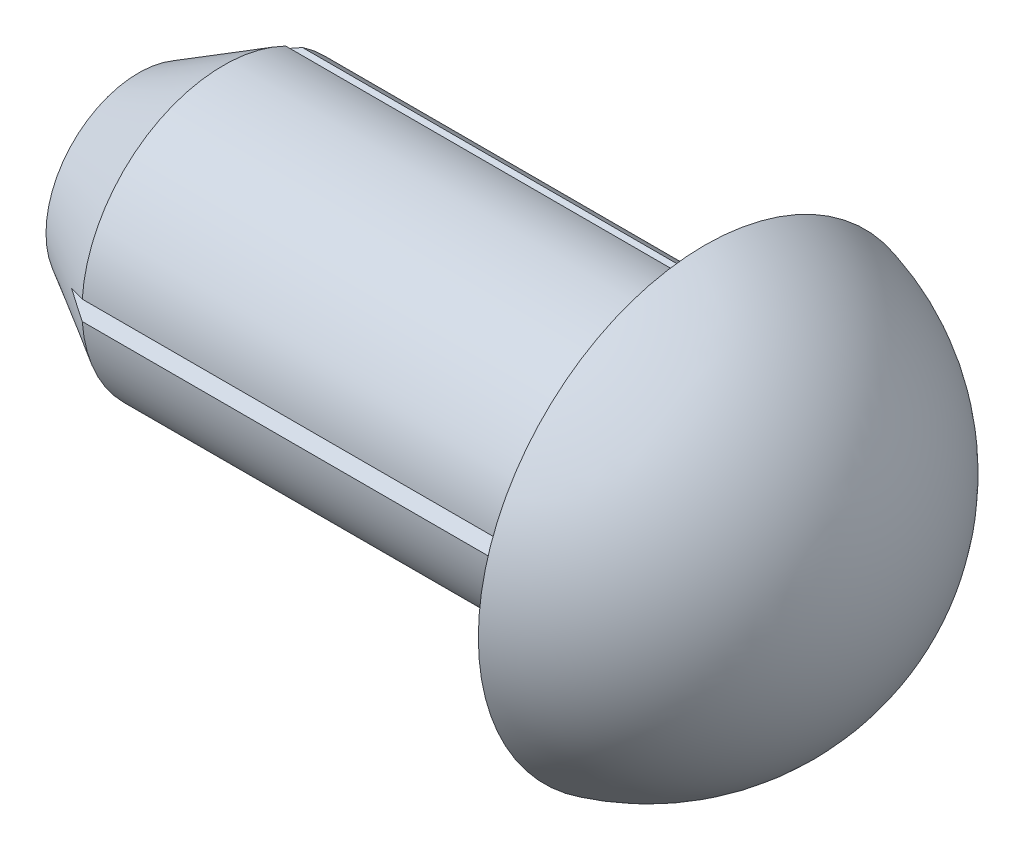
ISO-10303-21;
HEADER;
FILE_DESCRIPTION(('STEP AP214'),'2;1');
FILE_NAME('part.step','',(''),(''),'','','');
FILE_SCHEMA(('AUTOMOTIVE_DESIGN { 1 0 10303 214 1 1 1 1 }'));
ENDSEC;
DATA;
#1=APPLICATION_CONTEXT('core data for automotive mechanical design processes');
#2=APPLICATION_PROTOCOL_DEFINITION('international standard','automotive_design',2000,#1);
#3=PRODUCT_CONTEXT('',#1,'mechanical');
#4=PRODUCT('Part','Part','',(#3));
#5=PRODUCT_RELATED_PRODUCT_CATEGORY('part','',(#4));
#6=PRODUCT_DEFINITION_FORMATION('','',#4);
#7=PRODUCT_DEFINITION_CONTEXT('part definition',#1,'design');
#8=PRODUCT_DEFINITION('design','',#6,#7);
#9=PRODUCT_DEFINITION_SHAPE('','',#8);
#10=(LENGTH_UNIT() NAMED_UNIT(*) SI_UNIT(.MILLI.,.METRE.));
#11=(NAMED_UNIT(*) PLANE_ANGLE_UNIT() SI_UNIT($,.RADIAN.));
#12=(NAMED_UNIT(*) SI_UNIT($,.STERADIAN.) SOLID_ANGLE_UNIT());
#13=UNCERTAINTY_MEASURE_WITH_UNIT(LENGTH_MEASURE(1.E-05),#10,'distance_accuracy_value','');
#14=(GEOMETRIC_REPRESENTATION_CONTEXT(3) GLOBAL_UNCERTAINTY_ASSIGNED_CONTEXT((#13)) GLOBAL_UNIT_ASSIGNED_CONTEXT((#10,
#11,#12)) REPRESENTATION_CONTEXT('',''));
#15=CARTESIAN_POINT('',(0.,0.,0.));
#16=DIRECTION('',(0.,0.,1.));
#17=DIRECTION('',(1.,0.,0.));
#18=AXIS2_PLACEMENT_3D('',#15,#16,#17);
#19=CARTESIAN_POINT('',(-4.03112887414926,0.,0.));
#20=DIRECTION('',(-1.,0.,0.));
#21=DIRECTION('',(0.,1.,0.));
#22=AXIS2_PLACEMENT_3D('',#19,#20,#21);
#23=SPHERICAL_SURFACE('',#22,16.5);
#24=CARTESIAN_POINT('',(0.,0.,0.));
#25=DIRECTION('',(-1.,0.,0.));
#26=DIRECTION('',(0.,0.,1.));
#27=AXIS2_PLACEMENT_3D('',#24,#25,#26);
#28=CIRCLE('',#27,16.);
#29=CARTESIAN_POINT('',(0.,0.,16.));
#30=VERTEX_POINT('',#29);
#31=EDGE_CURVE('E161',#30,#30,#28,.T.);
#32=ORIENTED_EDGE('',*,*,#31,.F.);
#33=EDGE_LOOP('',(#32));
#34=FACE_BOUND('',#33,.T.);
#35=ADVANCED_FACE('F33',(#34),#23,.T.);
#36=CARTESIAN_POINT('',(0.,10.,0.));
#37=DIRECTION('',(1.,0.,0.));
#38=DIRECTION('',(0.,0.,-1.));
#39=AXIS2_PLACEMENT_3D('',#36,#37,#38);
#40=PLANE('',#39);
#41=CARTESIAN_POINT('',(0.,0.,0.));
#42=DIRECTION('',(-1.,0.,0.));
#43=DIRECTION('',(0.,0.,1.));
#44=AXIS2_PLACEMENT_3D('',#41,#42,#43);
#45=CIRCLE('',#44,10.);
#46=CARTESIAN_POINT('',(0.,0.,10.));
#47=VERTEX_POINT('',#46);
#48=EDGE_CURVE('E157',#47,#47,#45,.T.);
#49=ORIENTED_EDGE('',*,*,#48,.F.);
#50=EDGE_LOOP('',(#49));
#51=FACE_BOUND('',#50,.T.);
#52=ORIENTED_EDGE('',*,*,#31,.T.);
#53=EDGE_LOOP('',(#52));
#54=FACE_BOUND('',#53,.T.);
#55=ADVANCED_FACE('F205',(#51,#54),#40,.F.);
#56=CARTESIAN_POINT('',(-40.,0.,0.));
#57=DIRECTION('',(-1.,0.,0.));
#58=DIRECTION('',(0.,0.,1.));
#59=AXIS2_PLACEMENT_3D('',#56,#57,#58);
#60=CYLINDRICAL_SURFACE('',#59,10.);
#61=CARTESIAN_POINT('',(-3.,0.,0.));
#62=DIRECTION('',(-1.,0.,0.));
#63=DIRECTION('',(0.,0.,1.));
#64=AXIS2_PLACEMENT_3D('',#61,#62,#63);
#65=CIRCLE('',#64,10.);
#66=CARTESIAN_POINT('',(-3.,8.98189101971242,-4.39609300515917));
#67=VERTEX_POINT('',#66);
#68=CARTESIAN_POINT('',(-3.,8.29807372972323,-5.58049929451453));
#69=VERTEX_POINT('',#68);
#70=EDGE_CURVE('E11',#67,#69,#65,.T.);
#71=ORIENTED_EDGE('',*,*,#70,.F.);
#72=DIRECTION('',(-1.,0.,0.));
#73=VECTOR('',#72,1.);
#74=CARTESIAN_POINT('',(-40.,8.98189101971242,-4.39609300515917));
#75=LINE('',#74,#73);
#76=CARTESIAN_POINT('',(-34.,8.98189101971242,-4.39609300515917));
#77=VERTEX_POINT('',#76);
#78=EDGE_CURVE('E119',#67,#77,#75,.T.);
#79=ORIENTED_EDGE('',*,*,#78,.T.);
#80=CARTESIAN_POINT('',(-34.,0.,0.));
#81=DIRECTION('',(-1.,0.,0.));
#82=DIRECTION('',(0.,0.,1.));
#83=AXIS2_PLACEMENT_3D('',#80,#81,#82);
#84=CIRCLE('',#83,10.);
#85=CARTESIAN_POINT('',(-34.,0.683817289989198,9.97659229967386));
#86=VERTEX_POINT('',#85);
#87=EDGE_CURVE('E154',#86,#77,#84,.T.);
#88=ORIENTED_EDGE('',*,*,#87,.F.);
#89=DIRECTION('',(-1.,0.,0.));
#90=VECTOR('',#89,1.);
#91=CARTESIAN_POINT('',(-40.,0.683817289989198,9.97659229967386));
#92=LINE('',#91,#90);
#93=CARTESIAN_POINT('',(-3.,0.683817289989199,9.97659229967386));
#94=VERTEX_POINT('',#93);
#95=EDGE_CURVE('E144',#86,#94,#92,.F.);
#96=ORIENTED_EDGE('',*,*,#95,.T.);
#97=CARTESIAN_POINT('',(-3.,0.,0.));
#98=DIRECTION('',(-1.,0.,0.));
#99=DIRECTION('',(0.,0.,1.));
#100=AXIS2_PLACEMENT_3D('',#97,#98,#99);
#101=CIRCLE('',#100,10.);
#102=CARTESIAN_POINT('',(-3.,-0.683817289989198,9.97659229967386));
#103=VERTEX_POINT('',#102);
#104=EDGE_CURVE('E233',#103,#94,#101,.T.);
#105=ORIENTED_EDGE('',*,*,#104,.F.);
#106=DIRECTION('',(-1.,0.,0.));
#107=VECTOR('',#106,1.);
#108=CARTESIAN_POINT('',(-40.,-0.683817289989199,9.97659229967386));
#109=LINE('',#108,#107);
#110=CARTESIAN_POINT('',(-34.,-0.683817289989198,9.97659229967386));
#111=VERTEX_POINT('',#110);
#112=EDGE_CURVE('E147',#103,#111,#109,.T.);
#113=ORIENTED_EDGE('',*,*,#112,.T.);
#114=CARTESIAN_POINT('',(-34.,-8.98189101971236,-4.3960930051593));
#115=VERTEX_POINT('',#114);
#116=EDGE_CURVE('E153',#115,#111,#84,.T.);
#117=ORIENTED_EDGE('',*,*,#116,.F.);
#118=DIRECTION('',(-1.,0.,0.));
#119=VECTOR('',#118,1.);
#120=CARTESIAN_POINT('',(-40.,-8.98189101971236,-4.3960930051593));
#121=LINE('',#120,#119);
#122=CARTESIAN_POINT('',(-3.,-8.98189101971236,-4.3960930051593));
#123=VERTEX_POINT('',#122);
#124=EDGE_CURVE('E55',#115,#123,#121,.F.);
#125=ORIENTED_EDGE('',*,*,#124,.T.);
#126=CARTESIAN_POINT('',(-3.,0.,0.));
#127=DIRECTION('',(-1.,0.,0.));
#128=DIRECTION('',(0.,0.,1.));
#129=AXIS2_PLACEMENT_3D('',#126,#127,#128);
#130=CIRCLE('',#129,10.);
#131=CARTESIAN_POINT('',(-3.,-8.29807372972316,-5.58049929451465));
#132=VERTEX_POINT('',#131);
#133=EDGE_CURVE('E262',#132,#123,#130,.T.);
#134=ORIENTED_EDGE('',*,*,#133,.F.);
#135=DIRECTION('',(-1.,0.,0.));
#136=VECTOR('',#135,1.);
#137=CARTESIAN_POINT('',(-40.,-8.29807372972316,-5.58049929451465));
#138=LINE('',#137,#136);
#139=CARTESIAN_POINT('',(-34.,-8.29807372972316,-5.58049929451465));
#140=VERTEX_POINT('',#139);
#141=EDGE_CURVE('E133',#132,#140,#138,.T.);
#142=ORIENTED_EDGE('',*,*,#141,.T.);
#143=CARTESIAN_POINT('',(-34.,8.29807372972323,-5.58049929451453));
#144=VERTEX_POINT('',#143);
#145=EDGE_CURVE('E158',#144,#140,#84,.T.);
#146=ORIENTED_EDGE('',*,*,#145,.F.);
#147=DIRECTION('',(-1.,0.,0.));
#148=VECTOR('',#147,1.);
#149=CARTESIAN_POINT('',(-40.,8.29807372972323,-5.58049929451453));
#150=LINE('',#149,#148);
#151=EDGE_CURVE('E47',#144,#69,#150,.F.);
#152=ORIENTED_EDGE('',*,*,#151,.T.);
#153=EDGE_LOOP('',(#71,#79,#88,#96,#105,#113,#117,#125,#134,#142,#146,#152));
#154=FACE_BOUND('',#153,.T.);
#155=ORIENTED_EDGE('',*,*,#48,.T.);
#156=EDGE_LOOP('',(#155));
#157=FACE_BOUND('',#156,.T.);
#158=ADVANCED_FACE('F202',(#154,#157),#60,.T.);
#159=CARTESIAN_POINT('',(-34.,0.,0.));
#160=DIRECTION('',(1.,0.,0.));
#161=DIRECTION('',(0.,0.,-1.));
#162=AXIS2_PLACEMENT_3D('',#159,#160,#161);
#163=CONICAL_SURFACE('',#162,10.,0.523598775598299);
#164=CARTESIAN_POINT('',(-40.,0.,0.));
#165=DIRECTION('',(-1.,0.,0.));
#166=DIRECTION('',(0.,0.,1.));
#167=AXIS2_PLACEMENT_3D('',#164,#165,#166);
#168=CIRCLE('',#167,6.53589838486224);
#169=CARTESIAN_POINT('',(-40.,0.,6.53589838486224));
#170=VERTEX_POINT('',#169);
#171=EDGE_CURVE('E150',#170,#170,#168,.T.);
#172=ORIENTED_EDGE('',*,*,#171,.F.);
#173=EDGE_LOOP('',(#172));
#174=FACE_BOUND('',#173,.T.);
#175=ORIENTED_EDGE('',*,*,#87,.T.);
#176=CARTESIAN_POINT('',(-33.9998,8.98202532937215,-4.39608125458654));
#177=CARTESIAN_POINT('',(-34.145138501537,8.88442165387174,-4.4046204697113));
#178=CARTESIAN_POINT('',(-34.2902715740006,8.78651373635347,-4.41318630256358));
#179=CARTESIAN_POINT('',(-34.5800731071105,8.59002629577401,-4.4303767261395));
#180=CARTESIAN_POINT('',(-34.7247415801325,8.49144679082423,-4.43900131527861));
#181=CARTESIAN_POINT('',(-35.0135685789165,8.29354740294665,-4.45631526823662));
#182=CARTESIAN_POINT('',(-35.1577271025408,8.1942275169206,-4.46500463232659));
#183=CARTESIAN_POINT('',(-35.445474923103,7.99476476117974,-4.48245536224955));
#184=CARTESIAN_POINT('',(-35.5890642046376,7.89462186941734,-4.49121673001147));
#185=CARTESIAN_POINT('',(-35.7323356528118,7.79402863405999,-4.50001749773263));
#186=B_SPLINE_CURVE_WITH_KNOTS('',3,(#176,#177,#178,#179,#180,#181,#182,#183,#184,#185),
.UNSPECIFIED.,.F.,.F.,(4,2,2,2,4),(0.,0.52583670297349,1.05165928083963,1.57748406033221,
2.10332297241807),.UNSPECIFIED.);
#187=CARTESIAN_POINT('',(-35.7320508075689,7.79422863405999,-4.49999999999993));
#188=VERTEX_POINT('',#187);
#189=EDGE_CURVE('E40',#77,#188,#186,.T.);
#190=ORIENTED_EDGE('',*,*,#189,.T.);
#191=CARTESIAN_POINT('',(-35.7323639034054,7.79413537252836,-4.49979999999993));
#192=CARTESIAN_POINT('',(-35.5890901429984,7.8368110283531,-4.59131823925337));
#193=CARTESIAN_POINT('',(-35.4454985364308,7.87929562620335,-4.68242675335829));
#194=CARTESIAN_POINT('',(-35.1577460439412,7.96391565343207,-4.86389498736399));
#195=CARTESIAN_POINT('',(-35.0135851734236,8.00605109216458,-4.95425472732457));
#196=CARTESIAN_POINT('',(-34.7247534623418,8.09000786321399,-5.13430060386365));
#197=CARTESIAN_POINT('',(-34.5800826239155,8.13182919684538,-5.2239867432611));
#198=CARTESIAN_POINT('',(-34.2902763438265,8.21518695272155,-5.40274802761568));
#199=CARTESIAN_POINT('',(-34.1451408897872,8.25672336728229,-5.49182315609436));
#200=CARTESIAN_POINT('',(-33.9998000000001,8.29813070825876,-5.58062148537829));
#201=B_SPLINE_CURVE_WITH_KNOTS('',3,(#191,#192,#193,#194,#195,#196,#197,#198,#199,#200),
.UNSPECIFIED.,.F.,.F.,(4,2,2,2,4),(0.,0.525847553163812,1.05168097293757,1.57751219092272,
2.10335753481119),.UNSPECIFIED.);
#202=EDGE_CURVE('E112',#188,#144,#201,.T.);
#203=ORIENTED_EDGE('',*,*,#202,.T.);
#204=ORIENTED_EDGE('',*,*,#145,.T.);
#205=CARTESIAN_POINT('',(-33.9998,-8.29813070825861,-5.58062148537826));
#206=CARTESIAN_POINT('',(-34.1451408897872,-8.25672336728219,-5.49182315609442));
#207=CARTESIAN_POINT('',(-34.2902763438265,-8.21518695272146,-5.40274802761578));
#208=CARTESIAN_POINT('',(-34.5800826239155,-8.13182919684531,-5.22398674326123));
#209=CARTESIAN_POINT('',(-34.7247534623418,-8.09000786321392,-5.13430060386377));
#210=CARTESIAN_POINT('',(-35.0135851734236,-8.00605109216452,-4.95425472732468));
#211=CARTESIAN_POINT('',(-35.1577460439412,-7.963915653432,-4.8638949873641));
#212=CARTESIAN_POINT('',(-35.4454985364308,-7.87929562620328,-4.6824267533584));
#213=CARTESIAN_POINT('',(-35.5890901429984,-7.83681102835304,-4.59131823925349));
#214=CARTESIAN_POINT('',(-35.7323639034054,-7.7941353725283,-4.49980000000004));
#215=B_SPLINE_CURVE_WITH_KNOTS('',3,(#205,#206,#207,#208,#209,#210,#211,#212,#213,#214),
.UNSPECIFIED.,.F.,.F.,(4,2,2,2,4),(0.,0.525845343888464,1.05167656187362,1.57750998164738,
2.10335753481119),.UNSPECIFIED.);
#216=CARTESIAN_POINT('',(-35.7320508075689,-7.79422863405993,-4.50000000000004));
#217=VERTEX_POINT('',#216);
#218=EDGE_CURVE('E236',#140,#217,#215,.T.);
#219=ORIENTED_EDGE('',*,*,#218,.T.);
#220=CARTESIAN_POINT('',(-35.7323356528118,-7.79402863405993,-4.50001749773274));
#221=CARTESIAN_POINT('',(-35.5890642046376,-7.89462186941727,-4.49121673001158));
#222=CARTESIAN_POINT('',(-35.445474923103,-7.99476476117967,-4.48245536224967));
#223=CARTESIAN_POINT('',(-35.1577271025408,-8.19422751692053,-4.4650046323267));
#224=CARTESIAN_POINT('',(-35.0135685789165,-8.29354740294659,-4.45631526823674));
#225=CARTESIAN_POINT('',(-34.7247415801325,-8.49144679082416,-4.43900131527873));
#226=CARTESIAN_POINT('',(-34.5800731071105,-8.59002629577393,-4.43037672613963));
#227=CARTESIAN_POINT('',(-34.2902715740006,-8.78651373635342,-4.4131863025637));
#228=CARTESIAN_POINT('',(-34.145138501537,-8.88442165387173,-4.40462046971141));
#229=CARTESIAN_POINT('',(-33.9998000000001,-8.98202532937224,-4.39608125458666));
#230=B_SPLINE_CURVE_WITH_KNOTS('',3,(#220,#221,#222,#223,#224,#225,#226,#227,#228,#229),
.UNSPECIFIED.,.F.,.F.,(4,2,2,2,4),(0.,0.525838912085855,1.05166369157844,1.57748626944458,
2.10332297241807),.UNSPECIFIED.);
#231=EDGE_CURVE('E230',#217,#115,#230,.T.);
#232=ORIENTED_EDGE('',*,*,#231,.T.);
#233=ORIENTED_EDGE('',*,*,#116,.T.);
#234=CARTESIAN_POINT('',(-33.9998,-0.683894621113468,9.97670273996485));
#235=CARTESIAN_POINT('',(-34.1451437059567,-0.627695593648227,9.89644221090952));
#236=CARTESIAN_POINT('',(-34.2902819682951,-0.571321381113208,9.81593149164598));
#237=CARTESIAN_POINT('',(-34.5800938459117,-0.458186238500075,9.65435776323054));
#238=CARTESIAN_POINT('',(-34.7247674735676,-0.401425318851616,9.57329476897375));
#239=CARTESIAN_POINT('',(-35.0136047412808,-0.287477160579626,9.41055993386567));
#240=CARTESIAN_POINT('',(-35.1577683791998,-0.230289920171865,9.32888809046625));
#241=CARTESIAN_POINT('',(-35.4455263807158,-0.115441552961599,9.16486762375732));
#242=CARTESIAN_POINT('',(-35.5891207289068,-0.0577804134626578,9.08251898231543));
#243=CARTESIAN_POINT('',(-35.7323972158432,0.000140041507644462,8.9998));
#244=B_SPLINE_CURVE_WITH_KNOTS('',3,(#234,#235,#236,#237,#238,#239,#240,#241,#242,#243),
.UNSPECIFIED.,.F.,.F.,(4,2,2,2,4),(0.,0.525855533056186,1.05169693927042,1.57754054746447,
2.10339828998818),.UNSPECIFIED.);
#245=CARTESIAN_POINT('',(-35.7320508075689,0.,9.));
#246=VERTEX_POINT('',#245);
#247=EDGE_CURVE('E172',#111,#246,#244,.T.);
#248=ORIENTED_EDGE('',*,*,#247,.T.);
#249=CARTESIAN_POINT('',(-35.7323972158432,-0.000140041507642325,8.9998));
#250=CARTESIAN_POINT('',(-35.5891207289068,0.0577804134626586,9.08251898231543));
#251=CARTESIAN_POINT('',(-35.4455263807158,0.115441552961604,9.16486762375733));
#252=CARTESIAN_POINT('',(-35.1577683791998,0.230289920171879,9.32888809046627));
#253=CARTESIAN_POINT('',(-35.0136047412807,0.287477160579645,9.4105599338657));
#254=CARTESIAN_POINT('',(-34.7247674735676,0.401425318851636,9.57329476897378));
#255=CARTESIAN_POINT('',(-34.5800938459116,0.458186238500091,9.65435776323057));
#256=CARTESIAN_POINT('',(-34.290281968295,0.571321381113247,9.81593149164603));
#257=CARTESIAN_POINT('',(-34.1451437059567,0.627695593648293,9.89644221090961));
#258=CARTESIAN_POINT('',(-33.9998,0.683894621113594,9.97670273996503));
#259=B_SPLINE_CURVE_WITH_KNOTS('',3,(#249,#250,#251,#252,#253,#254,#255,#256,#257,#258),
.UNSPECIFIED.,.F.,.F.,(4,2,2,2,4),(0.,0.525857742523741,1.05170135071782,1.57754275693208,
2.10339828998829),.UNSPECIFIED.);
#260=EDGE_CURVE('E164',#246,#86,#259,.T.);
#261=ORIENTED_EDGE('',*,*,#260,.T.);
#262=EDGE_LOOP('',(#175,#190,#203,#204,#219,#232,#233,#248,#261));
#263=FACE_BOUND('',#262,.T.);
#264=ADVANCED_FACE('F178',(#174,#263),#163,.T.);
#265=CARTESIAN_POINT('',(-40.,0.,0.));
#266=DIRECTION('',(1.,0.,0.));
#267=DIRECTION('',(0.,0.,-1.));
#268=AXIS2_PLACEMENT_3D('',#265,#266,#267);
#269=PLANE('',#268);
#270=ORIENTED_EDGE('',*,*,#171,.T.);
#271=EDGE_LOOP('',(#270));
#272=FACE_BOUND('',#271,.T.);
#273=ADVANCED_FACE('F194',(#272),#269,.F.);
#274=CARTESIAN_POINT('',(-3.,0.,9.));
#275=DIRECTION('',(-1.,0.,0.));
#276=DIRECTION('',(0.,0.,1.));
#277=AXIS2_PLACEMENT_3D('',#274,#275,#276);
#278=PLANE('',#277);
#279=ORIENTED_EDGE('',*,*,#104,.T.);
#280=DIRECTION('',(0.,-0.573576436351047,-0.819152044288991));
#281=VECTOR('',#280,1.);
#282=CARTESIAN_POINT('',(-3.,0.,9.));
#283=LINE('',#282,#281);
#284=CARTESIAN_POINT('',(-3.,0.,9.));
#285=VERTEX_POINT('',#284);
#286=EDGE_CURVE('E139',#94,#285,#283,.T.);
#287=ORIENTED_EDGE('',*,*,#286,.T.);
#288=DIRECTION('',(0.,-0.573576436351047,0.819152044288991));
#289=VECTOR('',#288,1.);
#290=CARTESIAN_POINT('',(-3.,0.,9.));
#291=LINE('',#290,#289);
#292=EDGE_CURVE('E136',#285,#103,#291,.T.);
#293=ORIENTED_EDGE('',*,*,#292,.T.);
#294=EDGE_LOOP('',(#279,#287,#293));
#295=FACE_BOUND('',#294,.T.);
#296=ADVANCED_FACE('F189',(#295),#278,.T.);
#297=CARTESIAN_POINT('',(-3.,0.,9.));
#298=DIRECTION('',(0.,-0.819152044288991,-0.573576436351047));
#299=DIRECTION('',(0.,0.573576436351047,-0.819152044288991));
#300=AXIS2_PLACEMENT_3D('',#297,#298,#299);
#301=PLANE('',#300);
#302=ORIENTED_EDGE('',*,*,#292,.F.);
#303=DIRECTION('',(-1.,0.,0.));
#304=VECTOR('',#303,1.);
#305=CARTESIAN_POINT('',(-3.,0.,9.));
#306=LINE('',#305,#304);
#307=EDGE_CURVE('E141',#285,#246,#306,.T.);
#308=ORIENTED_EDGE('',*,*,#307,.T.);
#309=ORIENTED_EDGE('',*,*,#247,.F.);
#310=ORIENTED_EDGE('',*,*,#112,.F.);
#311=EDGE_LOOP('',(#302,#308,#309,#310));
#312=FACE_BOUND('',#311,.T.);
#313=ADVANCED_FACE('F187',(#312),#301,.F.);
#314=CARTESIAN_POINT('',(-3.,0.,9.));
#315=DIRECTION('',(0.,0.819152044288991,-0.573576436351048));
#316=DIRECTION('',(0.,0.573576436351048,0.819152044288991));
#317=AXIS2_PLACEMENT_3D('',#314,#315,#316);
#318=PLANE('',#317);
#319=ORIENTED_EDGE('',*,*,#260,.F.);
#320=ORIENTED_EDGE('',*,*,#307,.F.);
#321=ORIENTED_EDGE('',*,*,#286,.F.);
#322=ORIENTED_EDGE('',*,*,#95,.F.);
#323=EDGE_LOOP('',(#319,#320,#321,#322));
#324=FACE_BOUND('',#323,.T.);
#325=ADVANCED_FACE('F182',(#324),#318,.F.);
#326=CARTESIAN_POINT('',(-3.,-7.79422863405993,-4.50000000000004));
#327=DIRECTION('',(-1.,0.,0.));
#328=DIRECTION('',(0.,-0.866025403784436,-0.500000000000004));
#329=AXIS2_PLACEMENT_3D('',#326,#327,#328);
#330=PLANE('',#329);
#331=DIRECTION('',(0.,-0.422618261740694,-0.906307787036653));
#332=VECTOR('',#331,1.);
#333=CARTESIAN_POINT('',(-3.,-7.79422863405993,-4.50000000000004));
#334=LINE('',#333,#332);
#335=CARTESIAN_POINT('',(-3.,-7.79422863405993,-4.50000000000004));
#336=VERTEX_POINT('',#335);
#337=EDGE_CURVE('E124',#336,#132,#334,.T.);
#338=ORIENTED_EDGE('',*,*,#337,.T.);
#339=ORIENTED_EDGE('',*,*,#133,.T.);
#340=DIRECTION('',(0.,0.996194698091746,-0.0871557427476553));
#341=VECTOR('',#340,1.);
#342=CARTESIAN_POINT('',(-3.,-7.79422863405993,-4.50000000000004));
#343=LINE('',#342,#341);
#344=EDGE_CURVE('E127',#123,#336,#343,.T.);
#345=ORIENTED_EDGE('',*,*,#344,.T.);
#346=EDGE_LOOP('',(#338,#339,#345));
#347=FACE_BOUND('',#346,.T.);
#348=ADVANCED_FACE('F186',(#347),#330,.T.);
#349=CARTESIAN_POINT('',(-3.,-7.79422863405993,-4.50000000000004));
#350=DIRECTION('',(0.,0.906307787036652,-0.422618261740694));
#351=DIRECTION('',(0.,0.422618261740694,0.906307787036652));
#352=AXIS2_PLACEMENT_3D('',#349,#350,#351);
#353=PLANE('',#352);
#354=ORIENTED_EDGE('',*,*,#337,.F.);
#355=DIRECTION('',(-1.,0.,0.));
#356=VECTOR('',#355,1.);
#357=CARTESIAN_POINT('',(-3.,-7.79422863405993,-4.50000000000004));
#358=LINE('',#357,#356);
#359=EDGE_CURVE('E129',#336,#217,#358,.T.);
#360=ORIENTED_EDGE('',*,*,#359,.T.);
#361=ORIENTED_EDGE('',*,*,#218,.F.);
#362=ORIENTED_EDGE('',*,*,#141,.F.);
#363=EDGE_LOOP('',(#354,#360,#361,#362));
#364=FACE_BOUND('',#363,.T.);
#365=ADVANCED_FACE('F251',(#364),#353,.F.);
#366=CARTESIAN_POINT('',(-3.,-7.79422863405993,-4.50000000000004));
#367=DIRECTION('',(0.,0.0871557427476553,0.996194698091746));
#368=DIRECTION('',(0.,-0.996194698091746,0.0871557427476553));
#369=AXIS2_PLACEMENT_3D('',#366,#367,#368);
#370=PLANE('',#369);
#371=ORIENTED_EDGE('',*,*,#231,.F.);
#372=ORIENTED_EDGE('',*,*,#359,.F.);
#373=ORIENTED_EDGE('',*,*,#344,.F.);
#374=ORIENTED_EDGE('',*,*,#124,.F.);
#375=EDGE_LOOP('',(#371,#372,#373,#374));
#376=FACE_BOUND('',#375,.T.);
#377=ADVANCED_FACE('F247',(#376),#370,.F.);
#378=CARTESIAN_POINT('',(-3.,7.79422863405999,-4.49999999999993));
#379=DIRECTION('',(-1.,0.,0.));
#380=DIRECTION('',(0.,0.866025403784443,-0.499999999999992));
#381=AXIS2_PLACEMENT_3D('',#378,#379,#380);
#382=PLANE('',#381);
#383=DIRECTION('',(0.,0.996194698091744,0.0871557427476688));
#384=VECTOR('',#383,1.);
#385=CARTESIAN_POINT('',(-3.,7.79422863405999,-4.49999999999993));
#386=LINE('',#385,#384);
#387=CARTESIAN_POINT('',(-3.,7.79422863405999,-4.49999999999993));
#388=VERTEX_POINT('',#387);
#389=EDGE_CURVE('E107',#388,#67,#386,.T.);
#390=ORIENTED_EDGE('',*,*,#389,.T.);
#391=ORIENTED_EDGE('',*,*,#70,.T.);
#392=DIRECTION('',(0.,-0.422618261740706,0.906307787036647));
#393=VECTOR('',#392,1.);
#394=CARTESIAN_POINT('',(-3.,7.79422863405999,-4.49999999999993));
#395=LINE('',#394,#393);
#396=EDGE_CURVE('E103',#69,#388,#395,.T.);
#397=ORIENTED_EDGE('',*,*,#396,.T.);
#398=EDGE_LOOP('',(#390,#391,#397));
#399=FACE_BOUND('',#398,.T.);
#400=ADVANCED_FACE('F105',(#399),#382,.T.);
#401=CARTESIAN_POINT('',(-3.,7.79422863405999,-4.49999999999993));
#402=DIRECTION('',(0.,-0.0871557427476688,0.996194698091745));
#403=DIRECTION('',(0.,-0.996194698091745,-0.0871557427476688));
#404=AXIS2_PLACEMENT_3D('',#401,#402,#403);
#405=PLANE('',#404);
#406=ORIENTED_EDGE('',*,*,#389,.F.);
#407=DIRECTION('',(-1.,0.,0.));
#408=VECTOR('',#407,1.);
#409=CARTESIAN_POINT('',(-3.,7.79422863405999,-4.49999999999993));
#410=LINE('',#409,#408);
#411=EDGE_CURVE('E108',#388,#188,#410,.T.);
#412=ORIENTED_EDGE('',*,*,#411,.T.);
#413=ORIENTED_EDGE('',*,*,#189,.F.);
#414=ORIENTED_EDGE('',*,*,#78,.F.);
#415=EDGE_LOOP('',(#406,#412,#413,#414));
#416=FACE_BOUND('',#415,.T.);
#417=ADVANCED_FACE('F117',(#416),#405,.F.);
#418=CARTESIAN_POINT('',(-3.,7.79422863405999,-4.49999999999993));
#419=DIRECTION('',(0.,-0.906307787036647,-0.422618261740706));
#420=DIRECTION('',(0.,0.422618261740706,-0.906307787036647));
#421=AXIS2_PLACEMENT_3D('',#418,#419,#420);
#422=PLANE('',#421);
#423=ORIENTED_EDGE('',*,*,#202,.F.);
#424=ORIENTED_EDGE('',*,*,#411,.F.);
#425=ORIENTED_EDGE('',*,*,#396,.F.);
#426=ORIENTED_EDGE('',*,*,#151,.F.);
#427=EDGE_LOOP('',(#423,#424,#425,#426));
#428=FACE_BOUND('',#427,.T.);
#429=ADVANCED_FACE('F111',(#428),#422,.F.);
#430=CLOSED_SHELL('',(#35,#55,#158,#264,#273,#296,#313,#325,#348,#365,#377,#400,#417,#429));
#431=MANIFOLD_SOLID_BREP('B2',#430);
#432=ADVANCED_BREP_SHAPE_REPRESENTATION('',(#18,#431),#14);
#433=SHAPE_DEFINITION_REPRESENTATION(#9,#432);
ENDSEC;
END-ISO-10303-21;
